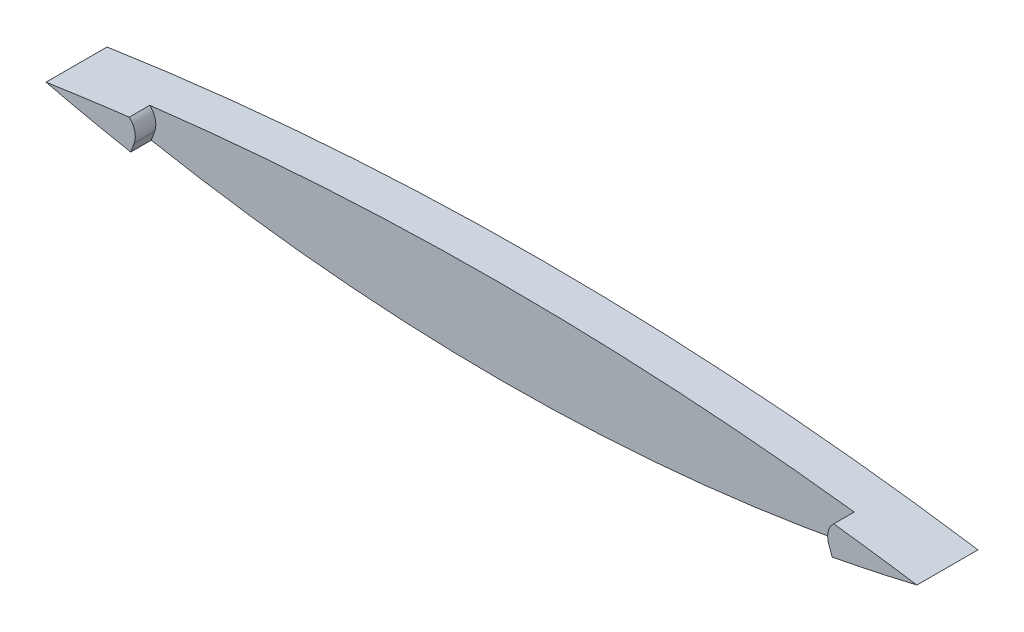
ISO-10303-21;
HEADER;
FILE_DESCRIPTION(('STEP AP214'),'2;1');
FILE_NAME('part.step','',(''),(''),'','','');
FILE_SCHEMA(('AUTOMOTIVE_DESIGN { 1 0 10303 214 1 1 1 1 }'));
ENDSEC;
DATA;
#1=APPLICATION_CONTEXT('core data for automotive mechanical design processes');
#2=APPLICATION_PROTOCOL_DEFINITION('international standard','automotive_design',2000,#1);
#3=PRODUCT_CONTEXT('',#1,'mechanical');
#4=PRODUCT('Part','Part','',(#3));
#5=PRODUCT_RELATED_PRODUCT_CATEGORY('part','',(#4));
#6=PRODUCT_DEFINITION_FORMATION('','',#4);
#7=PRODUCT_DEFINITION_CONTEXT('part definition',#1,'design');
#8=PRODUCT_DEFINITION('design','',#6,#7);
#9=PRODUCT_DEFINITION_SHAPE('','',#8);
#10=(LENGTH_UNIT() NAMED_UNIT(*) SI_UNIT(.MILLI.,.METRE.));
#11=(NAMED_UNIT(*) PLANE_ANGLE_UNIT() SI_UNIT($,.RADIAN.));
#12=(NAMED_UNIT(*) SI_UNIT($,.STERADIAN.) SOLID_ANGLE_UNIT());
#13=UNCERTAINTY_MEASURE_WITH_UNIT(LENGTH_MEASURE(1.E-05),#10,'distance_accuracy_value','');
#14=(GEOMETRIC_REPRESENTATION_CONTEXT(3) GLOBAL_UNCERTAINTY_ASSIGNED_CONTEXT((#13)) GLOBAL_UNIT_ASSIGNED_CONTEXT((#10,
#11,#12)) REPRESENTATION_CONTEXT('',''));
#15=CARTESIAN_POINT('',(0.,0.,0.));
#16=DIRECTION('',(0.,0.,1.));
#17=DIRECTION('',(1.,0.,0.));
#18=AXIS2_PLACEMENT_3D('',#15,#16,#17);
#19=CARTESIAN_POINT('',(0.,-28.2912038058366,1.08605));
#20=DIRECTION('',(0.,0.,1.));
#21=DIRECTION('',(1.,0.,0.));
#22=AXIS2_PLACEMENT_3D('',#19,#20,#21);
#23=PLANE('',#22);
#24=DIRECTION('',(0.342020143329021,-0.939692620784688,0.));
#25=VECTOR('',#24,1.);
#26=CARTESIAN_POINT('',(18.8082572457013,-0.973536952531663,1.08605));
#27=LINE('',#26,#25);
#28=CARTESIAN_POINT('',(18.625008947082,-0.470066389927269,1.08605));
#29=VERTEX_POINT('',#28);
#30=CARTESIAN_POINT('',(18.8082572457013,-0.973536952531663,1.08605));
#31=VERTEX_POINT('',#30);
#32=EDGE_CURVE('E122',#29,#31,#27,.T.);
#33=ORIENTED_EDGE('',*,*,#32,.F.);
#34=CARTESIAN_POINT('',(19.5647015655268,-0.128046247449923,1.08605));
#35=DIRECTION('',(0.,0.,1.));
#36=DIRECTION('',(-1.,0.,0.));
#37=AXIS2_PLACEMENT_3D('',#34,#35,#36);
#38=CIRCLE('',#37,0.99999999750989);
#39=CARTESIAN_POINT('',(18.8889398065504,0.609073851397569,1.08605));
#40=VERTEX_POINT('',#39);
#41=EDGE_CURVE('E124',#40,#29,#38,.T.);
#42=ORIENTED_EDGE('',*,*,#41,.F.);
#43=CARTESIAN_POINT('',(0.,-154.521585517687,1.08605));
#44=DIRECTION('',(0.,0.,1.));
#45=DIRECTION('',(1.,0.,0.));
#46=AXIS2_PLACEMENT_3D('',#43,#44,#45);
#47=CIRCLE('',#46,156.27640104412);
#48=CARTESIAN_POINT('',(-18.8889398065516,0.60907385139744,1.08605));
#49=VERTEX_POINT('',#48);
#50=EDGE_CURVE('E34',#40,#49,#47,.T.);
#51=ORIENTED_EDGE('',*,*,#50,.T.);
#52=CARTESIAN_POINT('',(-19.5647015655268,-0.128046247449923,1.08605));
#53=DIRECTION('',(0.,0.,1.));
#54=DIRECTION('',(1.,0.,0.));
#55=AXIS2_PLACEMENT_3D('',#52,#53,#54);
#56=CIRCLE('',#55,0.999999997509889);
#57=CARTESIAN_POINT('',(-18.625008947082,-0.470066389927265,1.08605));
#58=VERTEX_POINT('',#57);
#59=EDGE_CURVE('E134',#58,#49,#56,.T.);
#60=ORIENTED_EDGE('',*,*,#59,.F.);
#61=DIRECTION('',(0.342020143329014,0.939692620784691,0.));
#62=VECTOR('',#61,1.);
#63=CARTESIAN_POINT('',(-18.8082572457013,-0.973536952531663,1.08605));
#64=LINE('',#63,#62);
#65=CARTESIAN_POINT('',(-18.8082572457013,-0.973536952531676,1.08605));
#66=VERTEX_POINT('',#65);
#67=EDGE_CURVE('E56',#66,#58,#64,.T.);
#68=ORIENTED_EDGE('',*,*,#67,.F.);
#69=CARTESIAN_POINT('',(0.,97.9391779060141,1.08605));
#70=DIRECTION('',(0.,0.,1.));
#71=DIRECTION('',(1.,0.,0.));
#72=AXIS2_PLACEMENT_3D('',#69,#70,#71);
#73=CIRCLE('',#72,100.685032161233);
#74=EDGE_CURVE('E109',#66,#31,#73,.T.);
#75=ORIENTED_EDGE('',*,*,#74,.T.);
#76=EDGE_LOOP('',(#33,#42,#51,#60,#68,#75));
#77=FACE_BOUND('',#76,.T.);
#78=ADVANCED_FACE('F30',(#77),#23,.T.);
#79=CARTESIAN_POINT('',(0.,-154.521585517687,1.08605));
#80=DIRECTION('',(0.,0.,-1.));
#81=DIRECTION('',(-1.,0.,0.));
#82=AXIS2_PLACEMENT_3D('',#79,#80,#81);
#83=CYLINDRICAL_SURFACE('',#82,156.27640104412);
#84=CARTESIAN_POINT('',(0.,-154.521585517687,-1.08605));
#85=DIRECTION('',(0.,0.,1.));
#86=DIRECTION('',(1.,0.,0.));
#87=AXIS2_PLACEMENT_3D('',#84,#85,#86);
#88=CIRCLE('',#87,156.27640104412);
#89=CARTESIAN_POINT('',(23.3536535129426,0.,-1.08605));
#90=VERTEX_POINT('',#89);
#91=CARTESIAN_POINT('',(-23.3536535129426,0.,-1.08605));
#92=VERTEX_POINT('',#91);
#93=EDGE_CURVE('E155',#90,#92,#88,.T.);
#94=ORIENTED_EDGE('',*,*,#93,.T.);
#95=DIRECTION('',(0.,0.,-1.));
#96=VECTOR('',#95,1.);
#97=CARTESIAN_POINT('',(-23.3536535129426,0.,1.08605));
#98=LINE('',#97,#96);
#99=CARTESIAN_POINT('',(-23.3536535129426,0.,2.18605));
#100=VERTEX_POINT('',#99);
#101=EDGE_CURVE('E11',#100,#92,#98,.T.);
#102=ORIENTED_EDGE('',*,*,#101,.F.);
#103=CARTESIAN_POINT('',(0.,-154.521585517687,2.18605));
#104=DIRECTION('',(0.,0.,1.));
#105=DIRECTION('',(1.,0.,0.));
#106=AXIS2_PLACEMENT_3D('',#103,#104,#105);
#107=CIRCLE('',#106,156.27640104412);
#108=CARTESIAN_POINT('',(-18.8889398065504,0.609073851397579,2.18605));
#109=VERTEX_POINT('',#108);
#110=EDGE_CURVE('E138',#109,#100,#107,.T.);
#111=ORIENTED_EDGE('',*,*,#110,.F.);
#112=DIRECTION('',(0.,0.,-1.));
#113=VECTOR('',#112,1.);
#114=CARTESIAN_POINT('',(-18.8889398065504,0.609073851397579,2.18605));
#115=LINE('',#114,#113);
#116=EDGE_CURVE('E152',#109,#49,#115,.T.);
#117=ORIENTED_EDGE('',*,*,#116,.T.);
#118=ORIENTED_EDGE('',*,*,#50,.F.);
#119=DIRECTION('',(0.,0.,-1.));
#120=VECTOR('',#119,1.);
#121=CARTESIAN_POINT('',(18.8889398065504,0.609073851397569,2.18605));
#122=LINE('',#121,#120);
#123=CARTESIAN_POINT('',(18.8889398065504,0.609073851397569,2.18605));
#124=VERTEX_POINT('',#123);
#125=EDGE_CURVE('E114',#124,#40,#122,.T.);
#126=ORIENTED_EDGE('',*,*,#125,.F.);
#127=CARTESIAN_POINT('',(0.,-154.521585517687,2.18605));
#128=DIRECTION('',(0.,0.,1.));
#129=DIRECTION('',(-1.,0.,0.));
#130=AXIS2_PLACEMENT_3D('',#127,#128,#129);
#131=CIRCLE('',#130,156.27640104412);
#132=CARTESIAN_POINT('',(23.3536535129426,0.,2.18605));
#133=VERTEX_POINT('',#132);
#134=EDGE_CURVE('E112',#133,#124,#131,.T.);
#135=ORIENTED_EDGE('',*,*,#134,.F.);
#136=DIRECTION('',(0.,0.,-1.));
#137=VECTOR('',#136,1.);
#138=CARTESIAN_POINT('',(23.3536535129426,0.,1.08605));
#139=LINE('',#138,#137);
#140=EDGE_CURVE('E40',#133,#90,#139,.T.);
#141=ORIENTED_EDGE('',*,*,#140,.T.);
#142=EDGE_LOOP('',(#94,#102,#111,#117,#118,#126,#135,#141));
#143=FACE_BOUND('',#142,.T.);
#144=ADVANCED_FACE('F32',(#143),#83,.T.);
#145=CARTESIAN_POINT('',(0.,97.9391779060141,1.08605));
#146=DIRECTION('',(0.,0.,-1.));
#147=DIRECTION('',(-1.,0.,0.));
#148=AXIS2_PLACEMENT_3D('',#145,#146,#147);
#149=CYLINDRICAL_SURFACE('',#148,100.685032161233);
#150=CARTESIAN_POINT('',(0.,97.9391779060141,-1.08605));
#151=DIRECTION('',(0.,0.,1.));
#152=DIRECTION('',(1.,0.,0.));
#153=AXIS2_PLACEMENT_3D('',#150,#151,#152);
#154=CIRCLE('',#153,100.685032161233);
#155=EDGE_CURVE('E105',#92,#90,#154,.T.);
#156=ORIENTED_EDGE('',*,*,#155,.T.);
#157=ORIENTED_EDGE('',*,*,#140,.F.);
#158=CARTESIAN_POINT('',(0.,97.9391779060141,2.18605));
#159=DIRECTION('',(0.,0.,1.));
#160=DIRECTION('',(-1.,0.,0.));
#161=AXIS2_PLACEMENT_3D('',#158,#159,#160);
#162=CIRCLE('',#161,100.685032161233);
#163=CARTESIAN_POINT('',(18.8082572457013,-0.973536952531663,2.18605));
#164=VERTEX_POINT('',#163);
#165=EDGE_CURVE('E104',#164,#133,#162,.T.);
#166=ORIENTED_EDGE('',*,*,#165,.F.);
#167=DIRECTION('',(0.,0.,-1.));
#168=VECTOR('',#167,1.);
#169=CARTESIAN_POINT('',(18.8082572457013,-0.973536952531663,2.18605));
#170=LINE('',#169,#168);
#171=EDGE_CURVE('E129',#164,#31,#170,.T.);
#172=ORIENTED_EDGE('',*,*,#171,.T.);
#173=ORIENTED_EDGE('',*,*,#74,.F.);
#174=DIRECTION('',(0.,0.,-1.));
#175=VECTOR('',#174,1.);
#176=CARTESIAN_POINT('',(-18.8082572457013,-0.973536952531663,2.18605));
#177=LINE('',#176,#175);
#178=CARTESIAN_POINT('',(-18.8082572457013,-0.973536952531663,2.18605));
#179=VERTEX_POINT('',#178);
#180=EDGE_CURVE('E156',#179,#66,#177,.T.);
#181=ORIENTED_EDGE('',*,*,#180,.F.);
#182=CARTESIAN_POINT('',(0.,97.9391779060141,2.18605));
#183=DIRECTION('',(0.,0.,1.));
#184=DIRECTION('',(1.,0.,0.));
#185=AXIS2_PLACEMENT_3D('',#182,#183,#184);
#186=CIRCLE('',#185,100.685032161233);
#187=EDGE_CURVE('E141',#100,#179,#186,.T.);
#188=ORIENTED_EDGE('',*,*,#187,.F.);
#189=ORIENTED_EDGE('',*,*,#101,.T.);
#190=EDGE_LOOP('',(#156,#157,#166,#172,#173,#181,#188,#189));
#191=FACE_BOUND('',#190,.T.);
#192=ADVANCED_FACE('F101',(#191),#149,.T.);
#193=CARTESIAN_POINT('',(0.,-28.2912038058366,-1.08605));
#194=DIRECTION('',(0.,0.,1.));
#195=DIRECTION('',(1.,0.,0.));
#196=AXIS2_PLACEMENT_3D('',#193,#194,#195);
#197=PLANE('',#196);
#198=ORIENTED_EDGE('',*,*,#93,.F.);
#199=ORIENTED_EDGE('',*,*,#155,.F.);
#200=EDGE_LOOP('',(#198,#199));
#201=FACE_BOUND('',#200,.T.);
#202=ADVANCED_FACE('F202',(#201),#197,.F.);
#203=CARTESIAN_POINT('',(-19.5647015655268,-0.128046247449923,2.18605));
#204=DIRECTION('',(0.,0.,-1.));
#205=DIRECTION('',(-1.,0.,0.));
#206=AXIS2_PLACEMENT_3D('',#203,#204,#205);
#207=CYLINDRICAL_SURFACE('',#206,0.999999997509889);
#208=ORIENTED_EDGE('',*,*,#59,.T.);
#209=ORIENTED_EDGE('',*,*,#116,.F.);
#210=CARTESIAN_POINT('',(-19.5647015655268,-0.128046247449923,2.18605));
#211=DIRECTION('',(0.,0.,1.));
#212=DIRECTION('',(1.,0.,0.));
#213=AXIS2_PLACEMENT_3D('',#210,#211,#212);
#214=CIRCLE('',#213,0.999999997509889);
#215=CARTESIAN_POINT('',(-18.625008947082,-0.470066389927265,2.18605));
#216=VERTEX_POINT('',#215);
#217=EDGE_CURVE('E135',#216,#109,#214,.T.);
#218=ORIENTED_EDGE('',*,*,#217,.F.);
#219=DIRECTION('',(0.,0.,-1.));
#220=VECTOR('',#219,1.);
#221=CARTESIAN_POINT('',(-18.625008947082,-0.470066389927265,2.18605));
#222=LINE('',#221,#220);
#223=EDGE_CURVE('E145',#216,#58,#222,.T.);
#224=ORIENTED_EDGE('',*,*,#223,.T.);
#225=EDGE_LOOP('',(#208,#209,#218,#224));
#226=FACE_BOUND('',#225,.T.);
#227=ADVANCED_FACE('F175',(#226),#207,.T.);
#228=CARTESIAN_POINT('',(-18.8082572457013,-0.973536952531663,2.18605));
#229=DIRECTION('',(-0.939692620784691,0.342020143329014,0.));
#230=DIRECTION('',(-0.342020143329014,-0.939692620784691,0.));
#231=AXIS2_PLACEMENT_3D('',#228,#229,#230);
#232=PLANE('',#231);
#233=ORIENTED_EDGE('',*,*,#67,.T.);
#234=ORIENTED_EDGE('',*,*,#223,.F.);
#235=DIRECTION('',(0.342020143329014,0.939692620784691,0.));
#236=VECTOR('',#235,1.);
#237=CARTESIAN_POINT('',(-18.8082572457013,-0.973536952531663,2.18605));
#238=LINE('',#237,#236);
#239=EDGE_CURVE('E143',#179,#216,#238,.T.);
#240=ORIENTED_EDGE('',*,*,#239,.F.);
#241=ORIENTED_EDGE('',*,*,#180,.T.);
#242=EDGE_LOOP('',(#233,#234,#240,#241));
#243=FACE_BOUND('',#242,.T.);
#244=ADVANCED_FACE('F179',(#243),#232,.F.);
#245=CARTESIAN_POINT('',(-19.5647015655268,-0.128046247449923,2.18605));
#246=DIRECTION('',(0.,0.,1.));
#247=DIRECTION('',(1.,0.,0.));
#248=AXIS2_PLACEMENT_3D('',#245,#246,#247);
#249=PLANE('',#248);
#250=ORIENTED_EDGE('',*,*,#217,.T.);
#251=ORIENTED_EDGE('',*,*,#110,.T.);
#252=ORIENTED_EDGE('',*,*,#187,.T.);
#253=ORIENTED_EDGE('',*,*,#239,.T.);
#254=EDGE_LOOP('',(#250,#251,#252,#253));
#255=FACE_BOUND('',#254,.T.);
#256=ADVANCED_FACE('F191',(#255),#249,.T.);
#257=CARTESIAN_POINT('',(19.5647015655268,-0.128046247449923,2.18605));
#258=DIRECTION('',(0.,0.,-1.));
#259=DIRECTION('',(-1.,0.,0.));
#260=AXIS2_PLACEMENT_3D('',#257,#258,#259);
#261=CYLINDRICAL_SURFACE('',#260,0.99999999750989);
#262=ORIENTED_EDGE('',*,*,#41,.T.);
#263=DIRECTION('',(0.,0.,-1.));
#264=VECTOR('',#263,1.);
#265=CARTESIAN_POINT('',(18.625008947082,-0.470066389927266,2.18605));
#266=LINE('',#265,#264);
#267=CARTESIAN_POINT('',(18.625008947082,-0.470066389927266,2.18605));
#268=VERTEX_POINT('',#267);
#269=EDGE_CURVE('E48',#268,#29,#266,.T.);
#270=ORIENTED_EDGE('',*,*,#269,.F.);
#271=CARTESIAN_POINT('',(19.5647015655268,-0.128046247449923,2.18605));
#272=DIRECTION('',(0.,0.,1.));
#273=DIRECTION('',(-1.,0.,0.));
#274=AXIS2_PLACEMENT_3D('',#271,#272,#273);
#275=CIRCLE('',#274,0.99999999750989);
#276=EDGE_CURVE('E117',#124,#268,#275,.T.);
#277=ORIENTED_EDGE('',*,*,#276,.F.);
#278=ORIENTED_EDGE('',*,*,#125,.T.);
#279=EDGE_LOOP('',(#262,#270,#277,#278));
#280=FACE_BOUND('',#279,.T.);
#281=ADVANCED_FACE('F184',(#280),#261,.T.);
#282=CARTESIAN_POINT('',(18.8082572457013,-0.973536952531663,2.18605));
#283=DIRECTION('',(0.939692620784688,0.34202014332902,0.));
#284=DIRECTION('',(-0.34202014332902,0.939692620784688,0.));
#285=AXIS2_PLACEMENT_3D('',#282,#283,#284);
#286=PLANE('',#285);
#287=ORIENTED_EDGE('',*,*,#32,.T.);
#288=ORIENTED_EDGE('',*,*,#171,.F.);
#289=DIRECTION('',(0.342020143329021,-0.939692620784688,0.));
#290=VECTOR('',#289,1.);
#291=CARTESIAN_POINT('',(18.8082572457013,-0.973536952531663,2.18605));
#292=LINE('',#291,#290);
#293=EDGE_CURVE('E120',#268,#164,#292,.T.);
#294=ORIENTED_EDGE('',*,*,#293,.F.);
#295=ORIENTED_EDGE('',*,*,#269,.T.);
#296=EDGE_LOOP('',(#287,#288,#294,#295));
#297=FACE_BOUND('',#296,.T.);
#298=ADVANCED_FACE('F182',(#297),#286,.F.);
#299=CARTESIAN_POINT('',(0.,97.9391779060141,2.18605));
#300=DIRECTION('',(0.,0.,-1.));
#301=DIRECTION('',(-1.,0.,0.));
#302=AXIS2_PLACEMENT_3D('',#299,#300,#301);
#303=PLANE('',#302);
#304=ORIENTED_EDGE('',*,*,#165,.T.);
#305=ORIENTED_EDGE('',*,*,#134,.T.);
#306=ORIENTED_EDGE('',*,*,#276,.T.);
#307=ORIENTED_EDGE('',*,*,#293,.T.);
#308=EDGE_LOOP('',(#304,#305,#306,#307));
#309=FACE_BOUND('',#308,.T.);
#310=ADVANCED_FACE('F119',(#309),#303,.F.);
#311=CLOSED_SHELL('',(#78,#144,#192,#202,#227,#244,#256,#281,#298,#310));
#312=MANIFOLD_SOLID_BREP('B2',#311);
#313=ADVANCED_BREP_SHAPE_REPRESENTATION('',(#18,#312),#14);
#314=SHAPE_DEFINITION_REPRESENTATION(#9,#313);
ENDSEC;
END-ISO-10303-21;
